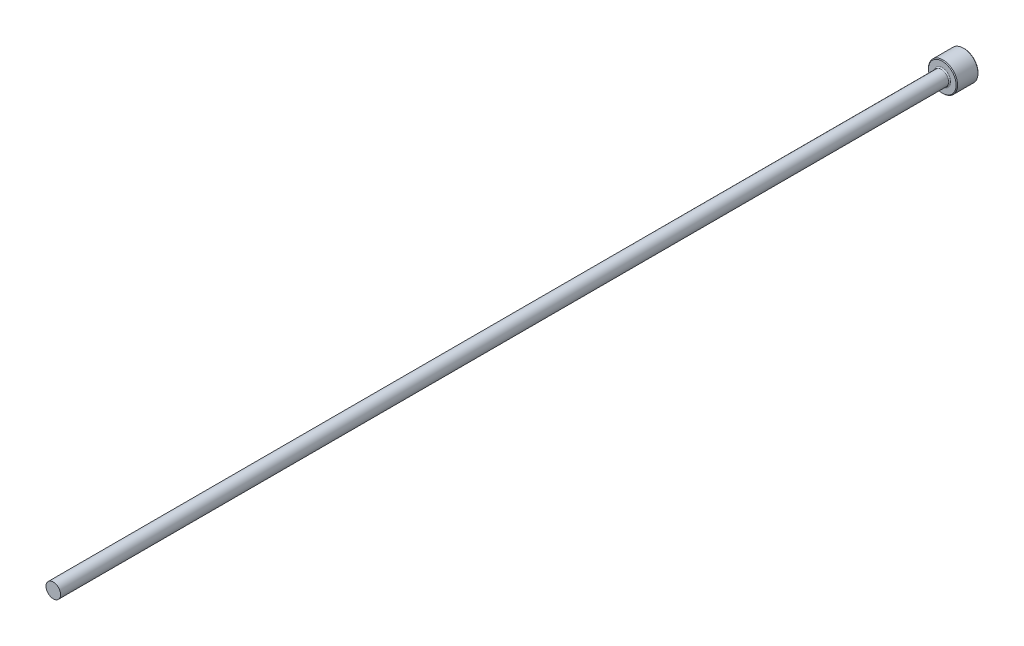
from build123d import *

# Parameters (mm, degrees)
CHAMFER1_SIZE = 0.2


with BuildPart() as part:
    # Sketch1 → Revolve1 (revolve)
    with BuildSketch(Plane(origin=(0, 0, 0), x_dir=(0, 0, -1), z_dir=(1, 0, 0)), mode=Mode.PRIVATE) as revolve1_sk:
        with BuildLine():
            Line((0, 0), (0, 4))
            Line((0, 4), (-6, 4))
            Line((-6, 4), (-6, 2.3))
            ThreePointArc((-6, 2.3), (-6.087867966, 2.087867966), (-6.3, 2))
            Line((-6.3, 2), (-250, 2))
            Line((-250, 2), (-250, 0))
            Line((-250, 0), (0, 0))
        make_face()
    revolve(revolve1_sk.sketch.rotate(Axis((0, 0, 109.05062828), (0, 0, -1)), 90), axis=Axis((0, 0, 109.05062828), (0, 0, -1)))

    # Chamfer1
    chamfer1_edges = [part.edges().sort_by_distance(p)[0] for p in [
        (-4, 0, 0),
        (-4, 0, 6),
    ]]
    chamfer(chamfer1_edges, length=CHAMFER1_SIZE)


solid = part.part
